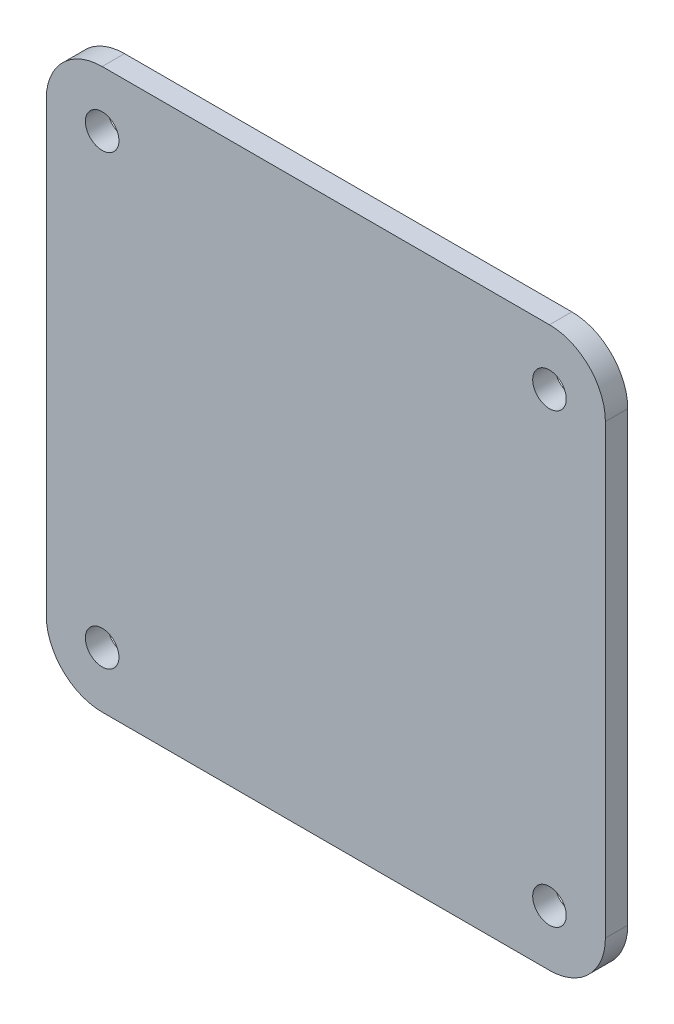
from build123d import *

# Parameters (mm, degrees)
ESQUISSE1_W             = 100
ESQUISSE1_H             = 100
BOSS_EXTRU_1_DEPTH      = 4
CONG_1_R                = 10
ESQUISSE2_R             = 3
ENL_V_MAT_EXTRU_1_DEPTH = 142.477913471


with BuildPart() as part:
    # Esquisse1 → Boss.-Extru.1 (new body)
    with BuildSketch(Plane.XY):
        with Locations((-50, 50)):
            Rectangle(ESQUISSE1_W, ESQUISSE1_H)
    extrude(amount=BOSS_EXTRU_1_DEPTH)

    # Cong_1
    cong_1_edges = [part.edges().sort_by_distance(p)[0] for p in [
        (0, 0, 2),
        (-100, 0, 2),
        (-100, 100, 2),
        (0, 100, 2),
    ]]
    fillet(cong_1_edges, radius=CONG_1_R)

    # Esquisse2 → Enl_v. mat.-Extru.1 (cut, through all)
    with BuildSketch(Plane.XY.offset(4)):
        with Locations((-10, 10)):
            Circle(ESQUISSE2_R)
        with Locations((-10, 90)):
            Circle(ESQUISSE2_R)
        with Locations((-90, 10)):
            Circle(ESQUISSE2_R)
        with Locations((-90, 90)):
            Circle(ESQUISSE2_R)
    extrude(amount=-ENL_V_MAT_EXTRU_1_DEPTH, mode=Mode.SUBTRACT)


solid = part.part
